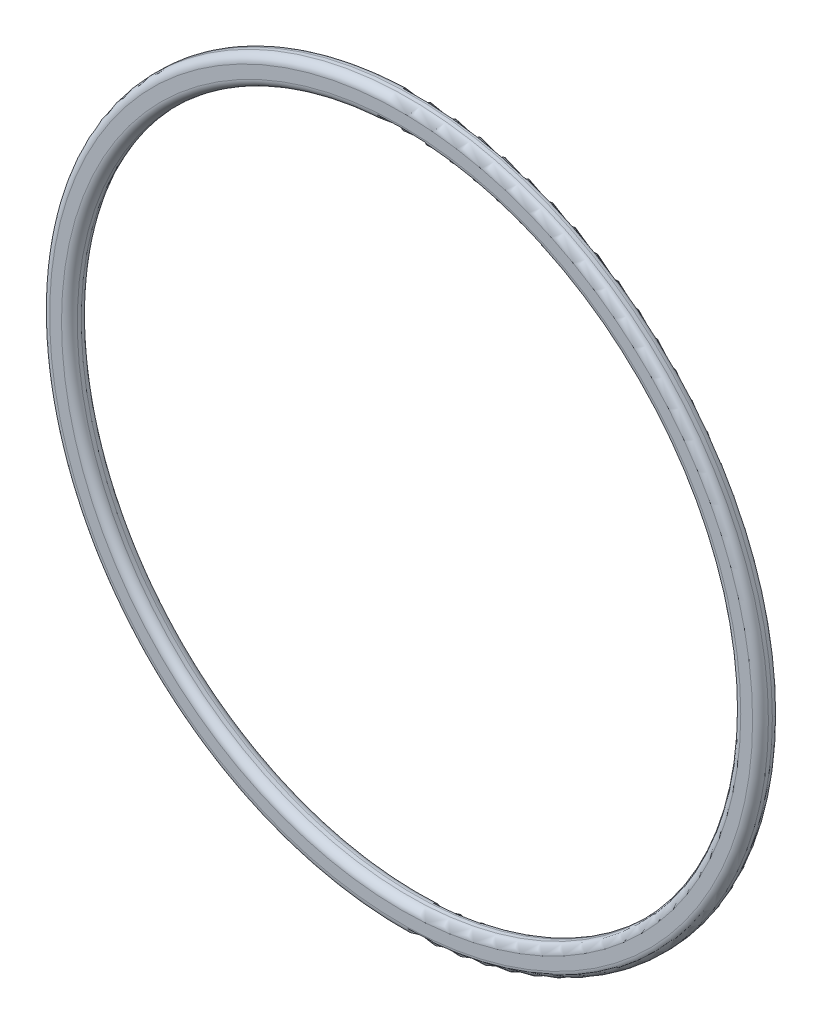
ISO-10303-21;
HEADER;
FILE_DESCRIPTION(('STEP AP214'),'2;1');
FILE_NAME('part.step','',(''),(''),'','','');
FILE_SCHEMA(('AUTOMOTIVE_DESIGN { 1 0 10303 214 1 1 1 1 }'));
ENDSEC;
DATA;
#1=APPLICATION_CONTEXT('core data for automotive mechanical design processes');
#2=APPLICATION_PROTOCOL_DEFINITION('international standard','automotive_design',2000,#1);
#3=PRODUCT_CONTEXT('',#1,'mechanical');
#4=PRODUCT('Part','Part','',(#3));
#5=PRODUCT_RELATED_PRODUCT_CATEGORY('part','',(#4));
#6=PRODUCT_DEFINITION_FORMATION('','',#4);
#7=PRODUCT_DEFINITION_CONTEXT('part definition',#1,'design');
#8=PRODUCT_DEFINITION('design','',#6,#7);
#9=PRODUCT_DEFINITION_SHAPE('','',#8);
#10=(LENGTH_UNIT() NAMED_UNIT(*) SI_UNIT(.MILLI.,.METRE.));
#11=(NAMED_UNIT(*) PLANE_ANGLE_UNIT() SI_UNIT($,.RADIAN.));
#12=(NAMED_UNIT(*) SI_UNIT($,.STERADIAN.) SOLID_ANGLE_UNIT());
#13=UNCERTAINTY_MEASURE_WITH_UNIT(LENGTH_MEASURE(1.E-05),#10,'distance_accuracy_value','');
#14=(GEOMETRIC_REPRESENTATION_CONTEXT(3) GLOBAL_UNCERTAINTY_ASSIGNED_CONTEXT((#13)) GLOBAL_UNIT_ASSIGNED_CONTEXT((#10,
#11,#12)) REPRESENTATION_CONTEXT('',''));
#15=CARTESIAN_POINT('',(0.,0.,0.));
#16=DIRECTION('',(0.,0.,1.));
#17=DIRECTION('',(1.,0.,0.));
#18=AXIS2_PLACEMENT_3D('',#15,#16,#17);
#19=CARTESIAN_POINT('',(0.,0.,-1.95936170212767));
#20=DIRECTION('',(0.,0.,1.));
#21=DIRECTION('',(1.,0.,0.));
#22=AXIS2_PLACEMENT_3D('',#19,#20,#21);
#23=TOROIDAL_SURFACE('',#22,43.,1.);
#24=CARTESIAN_POINT('',(0.,0.,-2.95936170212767));
#25=DIRECTION('',(0.,0.,1.));
#26=DIRECTION('',(1.,0.,0.));
#27=AXIS2_PLACEMENT_3D('',#24,#25,#26);
#28=CIRCLE('',#27,43.);
#29=CARTESIAN_POINT('',(43.,0.,-2.95936170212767));
#30=VERTEX_POINT('',#29);
#31=EDGE_CURVE('E10',#30,#30,#28,.T.);
#32=ORIENTED_EDGE('',*,*,#31,.F.);
#33=EDGE_LOOP('',(#32));
#34=FACE_BOUND('',#33,.T.);
#35=CARTESIAN_POINT('',(0.,0.,-1.95936170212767));
#36=DIRECTION('',(0.,0.,1.));
#37=DIRECTION('',(1.,0.,0.));
#38=AXIS2_PLACEMENT_3D('',#35,#36,#37);
#39=CIRCLE('',#38,42.);
#40=CARTESIAN_POINT('',(42.,0.,-1.95936170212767));
#41=VERTEX_POINT('',#40);
#42=EDGE_CURVE('E56',#41,#41,#39,.T.);
#43=ORIENTED_EDGE('',*,*,#42,.T.);
#44=EDGE_LOOP('',(#43));
#45=FACE_BOUND('',#44,.T.);
#46=ADVANCED_FACE('F28',(#34,#45),#23,.T.);
#47=CARTESIAN_POINT('',(0.,44.5,-2.95936170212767));
#48=DIRECTION('',(0.,0.,1.));
#49=DIRECTION('',(1.,0.,0.));
#50=AXIS2_PLACEMENT_3D('',#47,#48,#49);
#51=PLANE('',#50);
#52=CARTESIAN_POINT('',(0.,0.,-2.95936170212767));
#53=DIRECTION('',(0.,0.,1.));
#54=DIRECTION('',(1.,0.,0.));
#55=AXIS2_PLACEMENT_3D('',#52,#53,#54);
#56=CIRCLE('',#55,44.5);
#57=CARTESIAN_POINT('',(44.5,0.,-2.95936170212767));
#58=VERTEX_POINT('',#57);
#59=EDGE_CURVE('E34',#58,#58,#56,.T.);
#60=ORIENTED_EDGE('',*,*,#59,.F.);
#61=EDGE_LOOP('',(#60));
#62=FACE_BOUND('',#61,.T.);
#63=ORIENTED_EDGE('',*,*,#31,.T.);
#64=EDGE_LOOP('',(#63));
#65=FACE_BOUND('',#64,.T.);
#66=ADVANCED_FACE('F93',(#62,#65),#51,.F.);
#67=CARTESIAN_POINT('',(0.,0.,-1.95936170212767));
#68=DIRECTION('',(0.,0.,1.));
#69=DIRECTION('',(1.,0.,0.));
#70=AXIS2_PLACEMENT_3D('',#67,#68,#69);
#71=TOROIDAL_SURFACE('',#70,44.5,1.);
#72=CARTESIAN_POINT('',(0.,0.,-1.95936170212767));
#73=DIRECTION('',(0.,0.,1.));
#74=DIRECTION('',(1.,0.,0.));
#75=AXIS2_PLACEMENT_3D('',#72,#73,#74);
#76=CIRCLE('',#75,45.5);
#77=CARTESIAN_POINT('',(45.5,0.,-1.95936170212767));
#78=VERTEX_POINT('',#77);
#79=EDGE_CURVE('E38',#78,#78,#76,.T.);
#80=ORIENTED_EDGE('',*,*,#79,.F.);
#81=EDGE_LOOP('',(#80));
#82=FACE_BOUND('',#81,.T.);
#83=ORIENTED_EDGE('',*,*,#59,.T.);
#84=EDGE_LOOP('',(#83));
#85=FACE_BOUND('',#84,.T.);
#86=ADVANCED_FACE('F88',(#82,#85),#71,.T.);
#87=CARTESIAN_POINT('',(0.,0.,20.8243971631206));
#88=DIRECTION('',(0.,0.,1.));
#89=DIRECTION('',(1.,0.,0.));
#90=AXIS2_PLACEMENT_3D('',#87,#88,#89);
#91=CYLINDRICAL_SURFACE('',#90,45.5);
#92=CARTESIAN_POINT('',(0.,0.,-1.45936170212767));
#93=DIRECTION('',(0.,0.,1.));
#94=DIRECTION('',(1.,0.,0.));
#95=AXIS2_PLACEMENT_3D('',#92,#93,#94);
#96=CIRCLE('',#95,45.5);
#97=CARTESIAN_POINT('',(45.5,0.,-1.45936170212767));
#98=VERTEX_POINT('',#97);
#99=EDGE_CURVE('E42',#98,#98,#96,.T.);
#100=ORIENTED_EDGE('',*,*,#99,.F.);
#101=EDGE_LOOP('',(#100));
#102=FACE_BOUND('',#101,.T.);
#103=ORIENTED_EDGE('',*,*,#79,.T.);
#104=EDGE_LOOP('',(#103));
#105=FACE_BOUND('',#104,.T.);
#106=ADVANCED_FACE('F82',(#102,#105),#91,.T.);
#107=CARTESIAN_POINT('',(0.,0.,-1.45936170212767));
#108=DIRECTION('',(0.,0.,1.));
#109=DIRECTION('',(1.,0.,0.));
#110=AXIS2_PLACEMENT_3D('',#107,#108,#109);
#111=TOROIDAL_SURFACE('',#110,44.5,1.);
#112=CARTESIAN_POINT('',(0.,0.,-0.459361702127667));
#113=DIRECTION('',(0.,0.,1.));
#114=DIRECTION('',(1.,0.,0.));
#115=AXIS2_PLACEMENT_3D('',#112,#113,#114);
#116=CIRCLE('',#115,44.5);
#117=CARTESIAN_POINT('',(44.5,0.,-0.459361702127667));
#118=VERTEX_POINT('',#117);
#119=EDGE_CURVE('E47',#118,#118,#116,.T.);
#120=ORIENTED_EDGE('',*,*,#119,.F.);
#121=EDGE_LOOP('',(#120));
#122=FACE_BOUND('',#121,.T.);
#123=ORIENTED_EDGE('',*,*,#99,.T.);
#124=EDGE_LOOP('',(#123));
#125=FACE_BOUND('',#124,.T.);
#126=ADVANCED_FACE('F76',(#122,#125),#111,.T.);
#127=CARTESIAN_POINT('',(0.,44.5,-0.459361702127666));
#128=DIRECTION('',(0.,0.,-1.));
#129=DIRECTION('',(-1.,0.,0.));
#130=AXIS2_PLACEMENT_3D('',#127,#128,#129);
#131=PLANE('',#130);
#132=CARTESIAN_POINT('',(0.,0.,-0.459361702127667));
#133=DIRECTION('',(0.,0.,1.));
#134=DIRECTION('',(1.,0.,0.));
#135=AXIS2_PLACEMENT_3D('',#132,#133,#134);
#136=CIRCLE('',#135,43.);
#137=CARTESIAN_POINT('',(43.,0.,-0.459361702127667));
#138=VERTEX_POINT('',#137);
#139=EDGE_CURVE('E50',#138,#138,#136,.T.);
#140=ORIENTED_EDGE('',*,*,#139,.F.);
#141=EDGE_LOOP('',(#140));
#142=FACE_BOUND('',#141,.T.);
#143=ORIENTED_EDGE('',*,*,#119,.T.);
#144=EDGE_LOOP('',(#143));
#145=FACE_BOUND('',#144,.T.);
#146=ADVANCED_FACE('F70',(#142,#145),#131,.F.);
#147=CARTESIAN_POINT('',(0.,0.,-1.45936170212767));
#148=DIRECTION('',(0.,0.,1.));
#149=DIRECTION('',(1.,0.,0.));
#150=AXIS2_PLACEMENT_3D('',#147,#148,#149);
#151=TOROIDAL_SURFACE('',#150,43.,1.);
#152=CARTESIAN_POINT('',(0.,0.,-1.45936170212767));
#153=DIRECTION('',(0.,0.,1.));
#154=DIRECTION('',(1.,0.,0.));
#155=AXIS2_PLACEMENT_3D('',#152,#153,#154);
#156=CIRCLE('',#155,42.);
#157=CARTESIAN_POINT('',(42.,0.,-1.45936170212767));
#158=VERTEX_POINT('',#157);
#159=EDGE_CURVE('E53',#158,#158,#156,.T.);
#160=ORIENTED_EDGE('',*,*,#159,.F.);
#161=EDGE_LOOP('',(#160));
#162=FACE_BOUND('',#161,.T.);
#163=ORIENTED_EDGE('',*,*,#139,.T.);
#164=EDGE_LOOP('',(#163));
#165=FACE_BOUND('',#164,.T.);
#166=ADVANCED_FACE('F64',(#162,#165),#151,.T.);
#167=CARTESIAN_POINT('',(0.,0.,20.8243971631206));
#168=DIRECTION('',(0.,0.,1.));
#169=DIRECTION('',(1.,0.,0.));
#170=AXIS2_PLACEMENT_3D('',#167,#168,#169);
#171=CYLINDRICAL_SURFACE('',#170,42.);
#172=ORIENTED_EDGE('',*,*,#42,.F.);
#173=EDGE_LOOP('',(#172));
#174=FACE_BOUND('',#173,.T.);
#175=ORIENTED_EDGE('',*,*,#159,.T.);
#176=EDGE_LOOP('',(#175));
#177=FACE_BOUND('',#176,.T.);
#178=ADVANCED_FACE('F61',(#174,#177),#171,.F.);
#179=CLOSED_SHELL('',(#46,#66,#86,#106,#126,#146,#166,#178));
#180=MANIFOLD_SOLID_BREP('B2',#179);
#181=ADVANCED_BREP_SHAPE_REPRESENTATION('',(#18,#180),#14);
#182=SHAPE_DEFINITION_REPRESENTATION(#9,#181);
ENDSEC;
END-ISO-10303-21;
